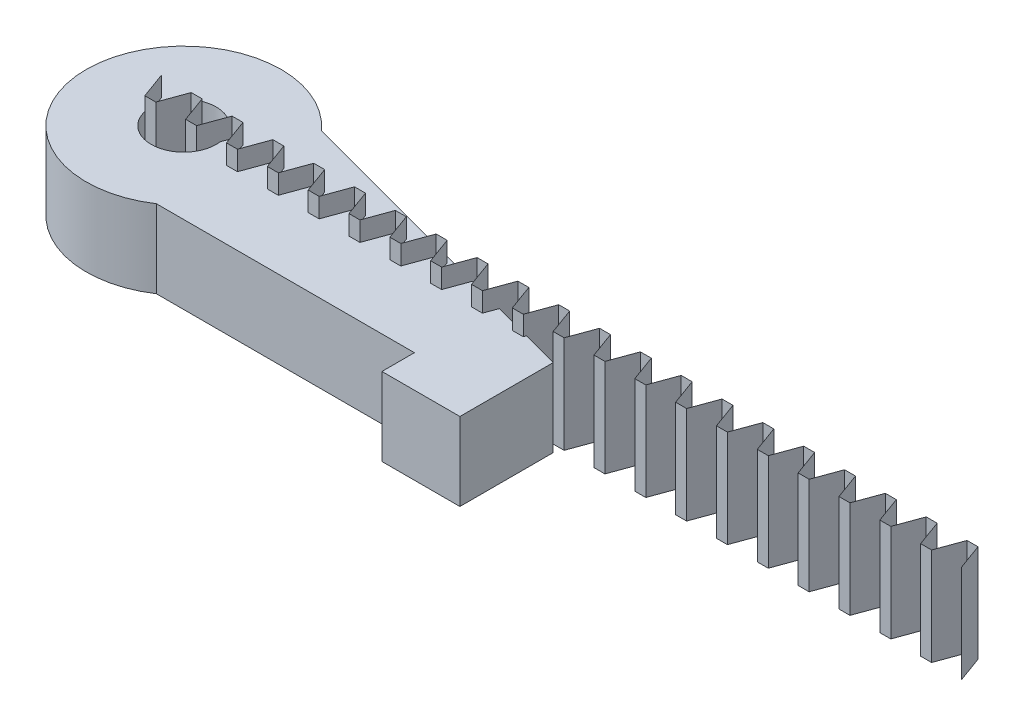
from build123d import *

# Parameters (mm, degrees)
SKIZZE1_R               = 5
LINEAR_AUSTRAGEN1_DEPTH = 12


with BuildPart() as part:
    # Skizze1 → Linear austragen1 (new body)
    with BuildSketch(Plane(origin=(0, 0, 0), x_dir=(1, 0, 0), z_dir=(0, 1, 0))):
        with BuildLine():
            Line((8.291561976, -12.5), (48, -12.5))
            Line((48, -12.5), (48, -17.5))
            Line((48, -17.5), (60, -17.5))
            Line((60, -17.5), (60, -3.135999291))
            Line((60, -3.135999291), (11.244271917, 9.928058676))
            ThreePointArc((11.244271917, 9.928058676), (-14.871672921, 1.957892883), (8.291561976, -12.5))
        make_face()
        with Locations(Location((0, 0, 0), (0, 0, 270))):
            Circle(SKIZZE1_R, mode=Mode.SUBTRACT)
    extrude(amount=LINEAR_AUSTRAGEN1_DEPTH)


solid = part.part
